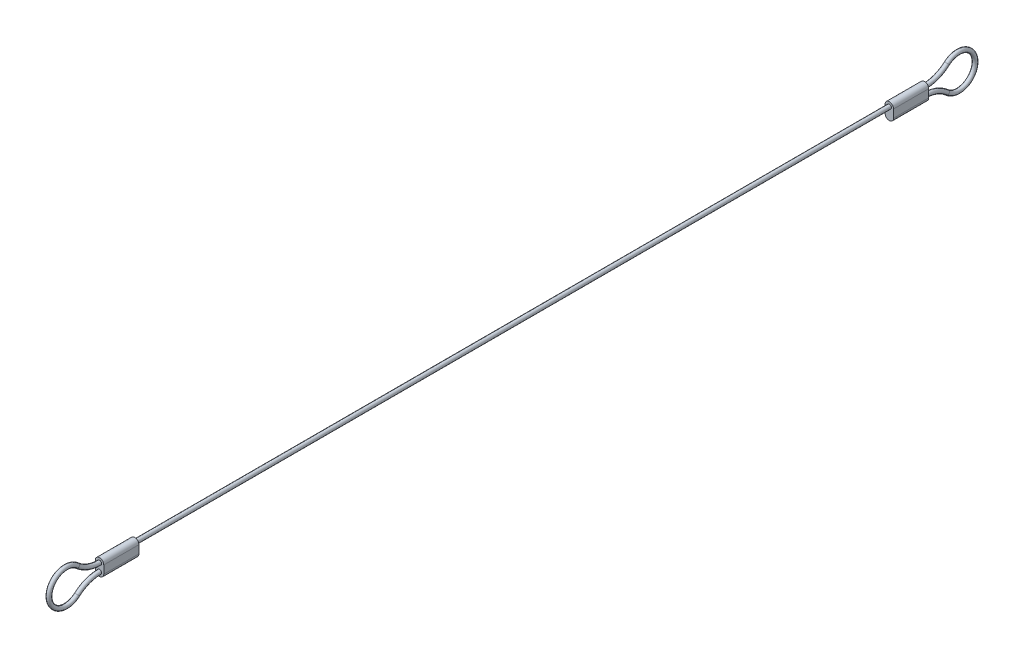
ISO-10303-21;
HEADER;
FILE_DESCRIPTION(('STEP AP214'),'2;1');
FILE_NAME('part.step','',(''),(''),'','','');
FILE_SCHEMA(('AUTOMOTIVE_DESIGN { 1 0 10303 214 1 1 1 1 }'));
ENDSEC;
DATA;
#1=APPLICATION_CONTEXT('core data for automotive mechanical design processes');
#2=APPLICATION_PROTOCOL_DEFINITION('international standard','automotive_design',2000,#1);
#3=PRODUCT_CONTEXT('',#1,'mechanical');
#4=PRODUCT('Part','Part','',(#3));
#5=PRODUCT_RELATED_PRODUCT_CATEGORY('part','',(#4));
#6=PRODUCT_DEFINITION_FORMATION('','',#4);
#7=PRODUCT_DEFINITION_CONTEXT('part definition',#1,'design');
#8=PRODUCT_DEFINITION('design','',#6,#7);
#9=PRODUCT_DEFINITION_SHAPE('','',#8);
#10=(LENGTH_UNIT() NAMED_UNIT(*) SI_UNIT(.MILLI.,.METRE.));
#11=(NAMED_UNIT(*) PLANE_ANGLE_UNIT() SI_UNIT($,.RADIAN.));
#12=(NAMED_UNIT(*) SI_UNIT($,.STERADIAN.) SOLID_ANGLE_UNIT());
#13=UNCERTAINTY_MEASURE_WITH_UNIT(LENGTH_MEASURE(1.E-05),#10,'distance_accuracy_value','');
#14=(GEOMETRIC_REPRESENTATION_CONTEXT(3) GLOBAL_UNCERTAINTY_ASSIGNED_CONTEXT((#13)) GLOBAL_UNIT_ASSIGNED_CONTEXT((#10,
#11,#12)) REPRESENTATION_CONTEXT('',''));
#15=CARTESIAN_POINT('',(0.,0.,0.));
#16=DIRECTION('',(0.,0.,1.));
#17=DIRECTION('',(1.,0.,0.));
#18=AXIS2_PLACEMENT_3D('',#15,#16,#17);
#19=CARTESIAN_POINT('',(0.,0.,-117.4));
#20=DIRECTION('',(0.,0.,1.));
#21=DIRECTION('',(1.,0.,0.));
#22=AXIS2_PLACEMENT_3D('',#19,#20,#21);
#23=CYLINDRICAL_SURFACE('',#22,0.595);
#24=CARTESIAN_POINT('',(0.,0.,-107.4));
#25=DIRECTION('',(0.,0.,1.));
#26=DIRECTION('',(0.,-1.,0.));
#27=AXIS2_PLACEMENT_3D('',#24,#25,#26);
#28=CIRCLE('',#27,0.595);
#29=CARTESIAN_POINT('',(0.,-0.595,-107.4));
#30=VERTEX_POINT('',#29);
#31=EDGE_CURVE('E11',#30,#30,#28,.F.);
#32=ORIENTED_EDGE('',*,*,#31,.F.);
#33=EDGE_LOOP('',(#32));
#34=FACE_BOUND('',#33,.T.);
#35=CARTESIAN_POINT('',(0.,0.,107.4));
#36=DIRECTION('',(0.,0.,-1.));
#37=DIRECTION('',(0.,1.,0.));
#38=AXIS2_PLACEMENT_3D('',#35,#36,#37);
#39=CIRCLE('',#38,0.595);
#40=CARTESIAN_POINT('',(0.,0.595,107.4));
#41=VERTEX_POINT('',#40);
#42=EDGE_CURVE('E51',#41,#41,#39,.F.);
#43=ORIENTED_EDGE('',*,*,#42,.F.);
#44=EDGE_LOOP('',(#43));
#45=FACE_BOUND('',#44,.T.);
#46=ADVANCED_FACE('F41',(#34,#45),#23,.T.);
#47=CARTESIAN_POINT('',(0.,1.69713780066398E-13,117.4));
#48=DIRECTION('',(0.,0.,-1.));
#49=DIRECTION('',(0.,1.,0.));
#50=AXIS2_PLACEMENT_3D('',#47,#48,#49);
#51=PLANE('',#50);
#52=CARTESIAN_POINT('',(0.,1.69713780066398E-13,117.4));
#53=DIRECTION('',(0.,0.,-1.));
#54=DIRECTION('',(0.,1.,0.));
#55=AXIS2_PLACEMENT_3D('',#52,#53,#54);
#56=CIRCLE('',#55,1.2);
#57=CARTESIAN_POINT('',(-1.2,1.69860737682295E-13,117.4));
#58=VERTEX_POINT('',#57);
#59=CARTESIAN_POINT('',(1.2,1.695668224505E-13,117.4));
#60=VERTEX_POINT('',#59);
#61=EDGE_CURVE('E185',#58,#60,#56,.T.);
#62=ORIENTED_EDGE('',*,*,#61,.F.);
#63=DIRECTION('',(0.,1.,0.));
#64=VECTOR('',#63,1.);
#65=CARTESIAN_POINT('',(-1.2,1.69860737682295E-13,117.4));
#66=LINE('',#65,#64);
#67=CARTESIAN_POINT('',(-1.2,-2.26625258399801,117.4));
#68=VERTEX_POINT('',#67);
#69=EDGE_CURVE('E83',#68,#58,#66,.T.);
#70=ORIENTED_EDGE('',*,*,#69,.F.);
#71=CARTESIAN_POINT('',(0.,-2.26625258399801,117.4));
#72=DIRECTION('',(0.,0.,-1.));
#73=DIRECTION('',(0.,1.,0.));
#74=AXIS2_PLACEMENT_3D('',#71,#72,#73);
#75=CIRCLE('',#74,1.2);
#76=CARTESIAN_POINT('',(1.2,-2.26625258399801,117.4));
#77=VERTEX_POINT('',#76);
#78=EDGE_CURVE('E77',#77,#68,#75,.T.);
#79=ORIENTED_EDGE('',*,*,#78,.F.);
#80=DIRECTION('',(0.,-1.,0.));
#81=VECTOR('',#80,1.);
#82=CARTESIAN_POINT('',(1.2,1.695668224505E-13,117.4));
#83=LINE('',#82,#81);
#84=EDGE_CURVE('E189',#60,#77,#83,.T.);
#85=ORIENTED_EDGE('',*,*,#84,.F.);
#86=EDGE_LOOP('',(#62,#70,#79,#85));
#87=FACE_BOUND('',#86,.T.);
#88=CARTESIAN_POINT('',(0.,0.,117.4));
#89=DIRECTION('',(0.,0.,-1.));
#90=DIRECTION('',(0.,1.,0.));
#91=AXIS2_PLACEMENT_3D('',#88,#89,#90);
#92=CIRCLE('',#91,0.595);
#93=CARTESIAN_POINT('',(0.,-0.595000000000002,117.4));
#94=VERTEX_POINT('',#93);
#95=EDGE_CURVE('E207',#94,#94,#92,.F.);
#96=ORIENTED_EDGE('',*,*,#95,.F.);
#97=EDGE_LOOP('',(#96));
#98=FACE_BOUND('',#97,.T.);
#99=CARTESIAN_POINT('',(0.,-2.26625258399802,117.4));
#100=DIRECTION('',(0.,0.,-1.));
#101=DIRECTION('',(1.,0.,0.));
#102=AXIS2_PLACEMENT_3D('',#99,#100,#101);
#103=CIRCLE('',#102,0.595);
#104=CARTESIAN_POINT('',(0.,-1.67125258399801,117.4));
#105=VERTEX_POINT('',#104);
#106=EDGE_CURVE('E233',#105,#105,#103,.T.);
#107=ORIENTED_EDGE('',*,*,#106,.T.);
#108=EDGE_LOOP('',(#107));
#109=FACE_BOUND('',#108,.T.);
#110=ADVANCED_FACE('F243',(#87,#98,#109),#51,.F.);
#111=CARTESIAN_POINT('',(0.,1.55257751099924E-13,107.4));
#112=DIRECTION('',(0.,0.,1.));
#113=DIRECTION('',(0.,-1.,0.));
#114=AXIS2_PLACEMENT_3D('',#111,#112,#113);
#115=CYLINDRICAL_SURFACE('',#114,1.2);
#116=ORIENTED_EDGE('',*,*,#61,.T.);
#117=DIRECTION('',(0.,0.,1.));
#118=VECTOR('',#117,1.);
#119=CARTESIAN_POINT('',(1.2,1.55110793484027E-13,107.4));
#120=LINE('',#119,#118);
#121=CARTESIAN_POINT('',(1.2,1.55110793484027E-13,107.4));
#122=VERTEX_POINT('',#121);
#123=EDGE_CURVE('E204',#122,#60,#120,.T.);
#124=ORIENTED_EDGE('',*,*,#123,.F.);
#125=CARTESIAN_POINT('',(0.,1.55257751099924E-13,107.4));
#126=DIRECTION('',(0.,0.,-1.));
#127=DIRECTION('',(0.,1.,0.));
#128=AXIS2_PLACEMENT_3D('',#125,#126,#127);
#129=CIRCLE('',#128,1.2);
#130=CARTESIAN_POINT('',(-1.2,1.55404708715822E-13,107.4));
#131=VERTEX_POINT('',#130);
#132=EDGE_CURVE('E174',#131,#122,#129,.T.);
#133=ORIENTED_EDGE('',*,*,#132,.F.);
#134=DIRECTION('',(0.,0.,1.));
#135=VECTOR('',#134,1.);
#136=CARTESIAN_POINT('',(-1.2,1.55404708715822E-13,107.4));
#137=LINE('',#136,#135);
#138=EDGE_CURVE('E184',#131,#58,#137,.T.);
#139=ORIENTED_EDGE('',*,*,#138,.T.);
#140=EDGE_LOOP('',(#116,#124,#133,#139));
#141=FACE_BOUND('',#140,.T.);
#142=ADVANCED_FACE('F249',(#141),#115,.T.);
#143=CARTESIAN_POINT('',(1.2,1.55110793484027E-13,107.4));
#144=DIRECTION('',(-1.,0.,0.));
#145=DIRECTION('',(0.,0.,1.));
#146=AXIS2_PLACEMENT_3D('',#143,#144,#145);
#147=PLANE('',#146);
#148=ORIENTED_EDGE('',*,*,#84,.T.);
#149=DIRECTION('',(0.,0.,1.));
#150=VECTOR('',#149,1.);
#151=CARTESIAN_POINT('',(1.2,-2.26625258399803,107.4));
#152=LINE('',#151,#150);
#153=CARTESIAN_POINT('',(1.2,-2.26625258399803,107.4));
#154=VERTEX_POINT('',#153);
#155=EDGE_CURVE('E201',#154,#77,#152,.T.);
#156=ORIENTED_EDGE('',*,*,#155,.F.);
#157=DIRECTION('',(0.,-1.,0.));
#158=VECTOR('',#157,1.);
#159=CARTESIAN_POINT('',(1.2,1.55110793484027E-13,107.4));
#160=LINE('',#159,#158);
#161=EDGE_CURVE('E91',#122,#154,#160,.T.);
#162=ORIENTED_EDGE('',*,*,#161,.F.);
#163=ORIENTED_EDGE('',*,*,#123,.T.);
#164=EDGE_LOOP('',(#148,#156,#162,#163));
#165=FACE_BOUND('',#164,.T.);
#166=ADVANCED_FACE('F291',(#165),#147,.F.);
#167=CARTESIAN_POINT('',(0.,-2.26625258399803,107.4));
#168=DIRECTION('',(0.,0.,1.));
#169=DIRECTION('',(0.,-1.,0.));
#170=AXIS2_PLACEMENT_3D('',#167,#168,#169);
#171=CYLINDRICAL_SURFACE('',#170,1.2);
#172=ORIENTED_EDGE('',*,*,#78,.T.);
#173=DIRECTION('',(0.,0.,1.));
#174=VECTOR('',#173,1.);
#175=CARTESIAN_POINT('',(-1.2,-2.26625258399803,107.4));
#176=LINE('',#175,#174);
#177=CARTESIAN_POINT('',(-1.2,-2.26625258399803,107.4));
#178=VERTEX_POINT('',#177);
#179=EDGE_CURVE('E198',#178,#68,#176,.T.);
#180=ORIENTED_EDGE('',*,*,#179,.F.);
#181=CARTESIAN_POINT('',(0.,-2.26625258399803,107.4));
#182=DIRECTION('',(0.,0.,-1.));
#183=DIRECTION('',(0.,1.,0.));
#184=AXIS2_PLACEMENT_3D('',#181,#182,#183);
#185=CIRCLE('',#184,1.2);
#186=EDGE_CURVE('E179',#154,#178,#185,.T.);
#187=ORIENTED_EDGE('',*,*,#186,.F.);
#188=ORIENTED_EDGE('',*,*,#155,.T.);
#189=EDGE_LOOP('',(#172,#180,#187,#188));
#190=FACE_BOUND('',#189,.T.);
#191=ADVANCED_FACE('F284',(#190),#171,.T.);
#192=CARTESIAN_POINT('',(-1.2,1.55404708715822E-13,107.4));
#193=DIRECTION('',(1.,0.,0.));
#194=DIRECTION('',(0.,1.,0.));
#195=AXIS2_PLACEMENT_3D('',#192,#193,#194);
#196=PLANE('',#195);
#197=ORIENTED_EDGE('',*,*,#69,.T.);
#198=ORIENTED_EDGE('',*,*,#138,.F.);
#199=DIRECTION('',(0.,1.,0.));
#200=VECTOR('',#199,1.);
#201=CARTESIAN_POINT('',(-1.2,1.55404708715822E-13,107.4));
#202=LINE('',#201,#200);
#203=EDGE_CURVE('E59',#178,#131,#202,.T.);
#204=ORIENTED_EDGE('',*,*,#203,.F.);
#205=ORIENTED_EDGE('',*,*,#179,.T.);
#206=EDGE_LOOP('',(#197,#198,#204,#205));
#207=FACE_BOUND('',#206,.T.);
#208=ADVANCED_FACE('F279',(#207),#196,.F.);
#209=CARTESIAN_POINT('',(0.,1.55257751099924E-13,107.4));
#210=DIRECTION('',(0.,0.,-1.));
#211=DIRECTION('',(0.,1.,0.));
#212=AXIS2_PLACEMENT_3D('',#209,#210,#211);
#213=PLANE('',#212);
#214=ORIENTED_EDGE('',*,*,#42,.T.);
#215=EDGE_LOOP('',(#214));
#216=FACE_BOUND('',#215,.T.);
#217=ORIENTED_EDGE('',*,*,#132,.T.);
#218=ORIENTED_EDGE('',*,*,#161,.T.);
#219=ORIENTED_EDGE('',*,*,#186,.T.);
#220=ORIENTED_EDGE('',*,*,#203,.T.);
#221=EDGE_LOOP('',(#217,#218,#219,#220));
#222=FACE_BOUND('',#221,.T.);
#223=ADVANCED_FACE('F240',(#216,#222),#213,.T.);
#224=CARTESIAN_POINT('',(0.,-11.866252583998,117.4));
#225=DIRECTION('',(-1.,0.,0.));
#226=DIRECTION('',(0.,0.,1.));
#227=AXIS2_PLACEMENT_3D('',#224,#225,#226);
#228=TOROIDAL_SURFACE('',#227,9.59999999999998,0.595);
#229=CARTESIAN_POINT('',(0.,-4.71083505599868,123.8));
#230=DIRECTION('',(0.,0.666666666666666,-0.74535599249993));
#231=DIRECTION('',(1.,0.,0.));
#232=AXIS2_PLACEMENT_3D('',#229,#230,#231);
#233=CIRCLE('',#232,0.595);
#234=CARTESIAN_POINT('',(0.,-4.26734824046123,124.196666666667));
#235=VERTEX_POINT('',#234);
#236=EDGE_CURVE('E229',#235,#235,#233,.T.);
#237=CARTESIAN_POINT('',(0.,-11.866252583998,117.4));
#238=DIRECTION('',(-1.,0.,0.));
#239=DIRECTION('',(0.,0.,1.));
#240=AXIS2_PLACEMENT_3D('',#237,#238,#239);
#241=CIRCLE('',#240,10.195);
#242=EDGE_CURVE('',#235,#105,#241,.T.);
#243=ORIENTED_EDGE('',*,*,#236,.T.);
#244=ORIENTED_EDGE('',*,*,#106,.F.);
#245=ORIENTED_EDGE('',*,*,#242,.T.);
#246=ORIENTED_EDGE('',*,*,#242,.F.);
#247=EDGE_LOOP('',(#243,#245,#244,#246));
#248=FACE_BOUND('',#247,.T.);
#249=ADVANCED_FACE('F43',(#248),#228,.T.);
#250=CARTESIAN_POINT('',(0.,-1.13312629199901,127.));
#251=DIRECTION('',(1.,0.,0.));
#252=DIRECTION('',(0.,0.,-1.));
#253=AXIS2_PLACEMENT_3D('',#250,#251,#252);
#254=TOROIDAL_SURFACE('',#253,4.80000000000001,0.595);
#255=ORIENTED_EDGE('',*,*,#236,.F.);
#256=EDGE_LOOP('',(#255));
#257=FACE_BOUND('',#256,.T.);
#258=CARTESIAN_POINT('',(0.,2.44458247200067,123.8));
#259=DIRECTION('',(0.,0.666666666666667,0.74535599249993));
#260=DIRECTION('',(1.,0.,0.));
#261=AXIS2_PLACEMENT_3D('',#258,#259,#260);
#262=CIRCLE('',#261,0.595);
#263=CARTESIAN_POINT('',(0.,2.00109565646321,124.196666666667));
#264=VERTEX_POINT('',#263);
#265=EDGE_CURVE('E225',#264,#264,#262,.T.);
#266=ORIENTED_EDGE('',*,*,#265,.T.);
#267=EDGE_LOOP('',(#266));
#268=FACE_BOUND('',#267,.T.);
#269=ADVANCED_FACE('F259',(#257,#268),#254,.T.);
#270=CARTESIAN_POINT('',(0.,9.59999999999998,117.4));
#271=DIRECTION('',(-1.,0.,0.));
#272=DIRECTION('',(0.,0.,1.));
#273=AXIS2_PLACEMENT_3D('',#270,#271,#272);
#274=TOROIDAL_SURFACE('',#273,9.59999999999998,0.595);
#275=CARTESIAN_POINT('',(0.,9.59999999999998,117.4));
#276=DIRECTION('',(-1.,0.,0.));
#277=DIRECTION('',(0.,0.,1.));
#278=AXIS2_PLACEMENT_3D('',#275,#276,#277);
#279=CIRCLE('',#278,10.195);
#280=EDGE_CURVE('',#94,#264,#279,.T.);
#281=ORIENTED_EDGE('',*,*,#95,.T.);
#282=ORIENTED_EDGE('',*,*,#265,.F.);
#283=ORIENTED_EDGE('',*,*,#280,.T.);
#284=ORIENTED_EDGE('',*,*,#280,.F.);
#285=EDGE_LOOP('',(#281,#283,#282,#284));
#286=FACE_BOUND('',#285,.T.);
#287=ADVANCED_FACE('F257',(#286),#274,.T.);
#288=CARTESIAN_POINT('',(0.,1.55257751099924E-13,-107.4));
#289=DIRECTION('',(0.,0.,-1.));
#290=DIRECTION('',(0.,1.,0.));
#291=AXIS2_PLACEMENT_3D('',#288,#289,#290);
#292=CYLINDRICAL_SURFACE('',#291,1.2);
#293=CARTESIAN_POINT('',(0.,1.69713780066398E-13,-117.4));
#294=DIRECTION('',(0.,0.,-1.));
#295=DIRECTION('',(0.,1.,0.));
#296=AXIS2_PLACEMENT_3D('',#293,#294,#295);
#297=CIRCLE('',#296,1.2);
#298=CARTESIAN_POINT('',(-1.2,1.69860737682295E-13,-117.4));
#299=VERTEX_POINT('',#298);
#300=CARTESIAN_POINT('',(1.2,1.695668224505E-13,-117.4));
#301=VERTEX_POINT('',#300);
#302=EDGE_CURVE('E124',#299,#301,#297,.T.);
#303=ORIENTED_EDGE('',*,*,#302,.F.);
#304=DIRECTION('',(0.,0.,-1.));
#305=VECTOR('',#304,1.);
#306=CARTESIAN_POINT('',(-1.2,1.55404708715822E-13,-107.4));
#307=LINE('',#306,#305);
#308=CARTESIAN_POINT('',(-1.2,1.55404708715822E-13,-107.4));
#309=VERTEX_POINT('',#308);
#310=EDGE_CURVE('E118',#309,#299,#307,.T.);
#311=ORIENTED_EDGE('',*,*,#310,.F.);
#312=CARTESIAN_POINT('',(0.,1.55257751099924E-13,-107.4));
#313=DIRECTION('',(0.,0.,-1.));
#314=DIRECTION('',(0.,1.,0.));
#315=AXIS2_PLACEMENT_3D('',#312,#313,#314);
#316=CIRCLE('',#315,1.2);
#317=CARTESIAN_POINT('',(1.2,1.55110793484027E-13,-107.4));
#318=VERTEX_POINT('',#317);
#319=EDGE_CURVE('E121',#309,#318,#316,.T.);
#320=ORIENTED_EDGE('',*,*,#319,.T.);
#321=DIRECTION('',(0.,0.,-1.));
#322=VECTOR('',#321,1.);
#323=CARTESIAN_POINT('',(1.2,1.55110793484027E-13,-107.4));
#324=LINE('',#323,#322);
#325=EDGE_CURVE('E155',#318,#301,#324,.T.);
#326=ORIENTED_EDGE('',*,*,#325,.T.);
#327=EDGE_LOOP('',(#303,#311,#320,#326));
#328=FACE_BOUND('',#327,.T.);
#329=ADVANCED_FACE('F120',(#328),#292,.T.);
#330=CARTESIAN_POINT('',(-1.2,1.55404708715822E-13,-107.4));
#331=DIRECTION('',(-1.,0.,0.));
#332=DIRECTION('',(0.,-1.,0.));
#333=AXIS2_PLACEMENT_3D('',#330,#331,#332);
#334=PLANE('',#333);
#335=DIRECTION('',(0.,1.,0.));
#336=VECTOR('',#335,1.);
#337=CARTESIAN_POINT('',(-1.2,1.69860737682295E-13,-117.4));
#338=LINE('',#337,#336);
#339=CARTESIAN_POINT('',(-1.2,-2.26625258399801,-117.4));
#340=VERTEX_POINT('',#339);
#341=EDGE_CURVE('E157',#340,#299,#338,.T.);
#342=ORIENTED_EDGE('',*,*,#341,.F.);
#343=DIRECTION('',(0.,0.,-1.));
#344=VECTOR('',#343,1.);
#345=CARTESIAN_POINT('',(-1.2,-2.26625258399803,-107.4));
#346=LINE('',#345,#344);
#347=CARTESIAN_POINT('',(-1.2,-2.26625258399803,-107.4));
#348=VERTEX_POINT('',#347);
#349=EDGE_CURVE('E131',#348,#340,#346,.T.);
#350=ORIENTED_EDGE('',*,*,#349,.F.);
#351=DIRECTION('',(0.,1.,0.));
#352=VECTOR('',#351,1.);
#353=CARTESIAN_POINT('',(-1.2,1.55404708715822E-13,-107.4));
#354=LINE('',#353,#352);
#355=EDGE_CURVE('E137',#348,#309,#354,.T.);
#356=ORIENTED_EDGE('',*,*,#355,.T.);
#357=ORIENTED_EDGE('',*,*,#310,.T.);
#358=EDGE_LOOP('',(#342,#350,#356,#357));
#359=FACE_BOUND('',#358,.T.);
#360=ADVANCED_FACE('F144',(#359),#334,.T.);
#361=CARTESIAN_POINT('',(0.,-2.26625258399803,-107.4));
#362=DIRECTION('',(0.,0.,-1.));
#363=DIRECTION('',(0.,1.,0.));
#364=AXIS2_PLACEMENT_3D('',#361,#362,#363);
#365=CYLINDRICAL_SURFACE('',#364,1.2);
#366=CARTESIAN_POINT('',(0.,-2.26625258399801,-117.4));
#367=DIRECTION('',(0.,0.,-1.));
#368=DIRECTION('',(0.,1.,0.));
#369=AXIS2_PLACEMENT_3D('',#366,#367,#368);
#370=CIRCLE('',#369,1.2);
#371=CARTESIAN_POINT('',(1.2,-2.26625258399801,-117.4));
#372=VERTEX_POINT('',#371);
#373=EDGE_CURVE('E160',#372,#340,#370,.T.);
#374=ORIENTED_EDGE('',*,*,#373,.F.);
#375=DIRECTION('',(0.,0.,-1.));
#376=VECTOR('',#375,1.);
#377=CARTESIAN_POINT('',(1.2,-2.26625258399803,-107.4));
#378=LINE('',#377,#376);
#379=CARTESIAN_POINT('',(1.2,-2.26625258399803,-107.4));
#380=VERTEX_POINT('',#379);
#381=EDGE_CURVE('E169',#380,#372,#378,.T.);
#382=ORIENTED_EDGE('',*,*,#381,.F.);
#383=CARTESIAN_POINT('',(0.,-2.26625258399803,-107.4));
#384=DIRECTION('',(0.,0.,-1.));
#385=DIRECTION('',(0.,1.,0.));
#386=AXIS2_PLACEMENT_3D('',#383,#384,#385);
#387=CIRCLE('',#386,1.2);
#388=EDGE_CURVE('E146',#380,#348,#387,.T.);
#389=ORIENTED_EDGE('',*,*,#388,.T.);
#390=ORIENTED_EDGE('',*,*,#349,.T.);
#391=EDGE_LOOP('',(#374,#382,#389,#390));
#392=FACE_BOUND('',#391,.T.);
#393=ADVANCED_FACE('F324',(#392),#365,.T.);
#394=CARTESIAN_POINT('',(1.2,1.55110793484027E-13,-107.4));
#395=DIRECTION('',(1.,0.,0.));
#396=DIRECTION('',(0.,0.,-1.));
#397=AXIS2_PLACEMENT_3D('',#394,#395,#396);
#398=PLANE('',#397);
#399=DIRECTION('',(0.,-1.,0.));
#400=VECTOR('',#399,1.);
#401=CARTESIAN_POINT('',(1.2,1.695668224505E-13,-117.4));
#402=LINE('',#401,#400);
#403=EDGE_CURVE('E142',#301,#372,#402,.T.);
#404=ORIENTED_EDGE('',*,*,#403,.F.);
#405=ORIENTED_EDGE('',*,*,#325,.F.);
#406=DIRECTION('',(0.,-1.,0.));
#407=VECTOR('',#406,1.);
#408=CARTESIAN_POINT('',(1.2,1.55110793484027E-13,-107.4));
#409=LINE('',#408,#407);
#410=EDGE_CURVE('E140',#318,#380,#409,.T.);
#411=ORIENTED_EDGE('',*,*,#410,.T.);
#412=ORIENTED_EDGE('',*,*,#381,.T.);
#413=EDGE_LOOP('',(#404,#405,#411,#412));
#414=FACE_BOUND('',#413,.T.);
#415=ADVANCED_FACE('F321',(#414),#398,.T.);
#416=CARTESIAN_POINT('',(0.,1.55257751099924E-13,-107.4));
#417=DIRECTION('',(0.,0.,1.));
#418=DIRECTION('',(0.,1.,0.));
#419=AXIS2_PLACEMENT_3D('',#416,#417,#418);
#420=PLANE('',#419);
#421=ORIENTED_EDGE('',*,*,#31,.T.);
#422=EDGE_LOOP('',(#421));
#423=FACE_BOUND('',#422,.T.);
#424=ORIENTED_EDGE('',*,*,#319,.F.);
#425=ORIENTED_EDGE('',*,*,#355,.F.);
#426=ORIENTED_EDGE('',*,*,#388,.F.);
#427=ORIENTED_EDGE('',*,*,#410,.F.);
#428=EDGE_LOOP('',(#424,#425,#426,#427));
#429=FACE_BOUND('',#428,.T.);
#430=ADVANCED_FACE('F135',(#423,#429),#420,.T.);
#431=CARTESIAN_POINT('',(0.,1.69713780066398E-13,-117.4));
#432=DIRECTION('',(0.,0.,1.));
#433=DIRECTION('',(0.,1.,0.));
#434=AXIS2_PLACEMENT_3D('',#431,#432,#433);
#435=PLANE('',#434);
#436=CARTESIAN_POINT('',(0.,-2.26625258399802,-117.4));
#437=DIRECTION('',(0.,0.,-1.));
#438=DIRECTION('',(1.,0.,0.));
#439=AXIS2_PLACEMENT_3D('',#436,#437,#438);
#440=CIRCLE('',#439,0.595);
#441=CARTESIAN_POINT('',(0.,-1.67125258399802,-117.4));
#442=VERTEX_POINT('',#441);
#443=EDGE_CURVE('E130',#442,#442,#440,.T.);
#444=ORIENTED_EDGE('',*,*,#443,.F.);
#445=EDGE_LOOP('',(#444));
#446=FACE_BOUND('',#445,.T.);
#447=CARTESIAN_POINT('',(0.,0.,-117.4));
#448=DIRECTION('',(0.,0.,1.));
#449=DIRECTION('',(1.,0.,0.));
#450=AXIS2_PLACEMENT_3D('',#447,#448,#449);
#451=CIRCLE('',#450,0.595);
#452=CARTESIAN_POINT('',(0.,-0.595000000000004,-117.4));
#453=VERTEX_POINT('',#452);
#454=EDGE_CURVE('E221',#453,#453,#451,.T.);
#455=ORIENTED_EDGE('',*,*,#454,.T.);
#456=EDGE_LOOP('',(#455));
#457=FACE_BOUND('',#456,.T.);
#458=ORIENTED_EDGE('',*,*,#302,.T.);
#459=ORIENTED_EDGE('',*,*,#403,.T.);
#460=ORIENTED_EDGE('',*,*,#373,.T.);
#461=ORIENTED_EDGE('',*,*,#341,.T.);
#462=EDGE_LOOP('',(#458,#459,#460,#461));
#463=FACE_BOUND('',#462,.T.);
#464=ADVANCED_FACE('F300',(#446,#457,#463),#435,.F.);
#465=CARTESIAN_POINT('',(0.,-11.866252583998,-117.4));
#466=DIRECTION('',(-1.,0.,0.));
#467=DIRECTION('',(0.,0.,1.));
#468=AXIS2_PLACEMENT_3D('',#465,#466,#467);
#469=TOROIDAL_SURFACE('',#468,9.59999999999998,0.595);
#470=CARTESIAN_POINT('',(0.,-4.71083505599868,-123.8));
#471=DIRECTION('',(0.,-0.666666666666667,-0.74535599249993));
#472=DIRECTION('',(1.,0.,0.));
#473=AXIS2_PLACEMENT_3D('',#470,#471,#472);
#474=CIRCLE('',#473,0.595);
#475=CARTESIAN_POINT('',(0.,-4.26734824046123,-124.196666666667));
#476=VERTEX_POINT('',#475);
#477=EDGE_CURVE('E210',#476,#476,#474,.T.);
#478=CARTESIAN_POINT('',(0.,-11.866252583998,-117.4));
#479=DIRECTION('',(-1.,0.,0.));
#480=DIRECTION('',(0.,0.,1.));
#481=AXIS2_PLACEMENT_3D('',#478,#479,#480);
#482=CIRCLE('',#481,10.195);
#483=EDGE_CURVE('',#442,#476,#482,.T.);
#484=ORIENTED_EDGE('',*,*,#443,.T.);
#485=ORIENTED_EDGE('',*,*,#477,.F.);
#486=ORIENTED_EDGE('',*,*,#483,.T.);
#487=ORIENTED_EDGE('',*,*,#483,.F.);
#488=EDGE_LOOP('',(#484,#486,#485,#487));
#489=FACE_BOUND('',#488,.T.);
#490=ADVANCED_FACE('F297',(#489),#469,.T.);
#491=CARTESIAN_POINT('',(0.,-1.13312629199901,-127.));
#492=DIRECTION('',(1.,0.,0.));
#493=DIRECTION('',(0.,0.,-1.));
#494=AXIS2_PLACEMENT_3D('',#491,#492,#493);
#495=TOROIDAL_SURFACE('',#494,4.80000000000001,0.595);
#496=CARTESIAN_POINT('',(0.,2.44458247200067,-123.8));
#497=DIRECTION('',(0.,-0.666666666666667,0.74535599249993));
#498=DIRECTION('',(1.,0.,0.));
#499=AXIS2_PLACEMENT_3D('',#496,#497,#498);
#500=CIRCLE('',#499,0.595);
#501=CARTESIAN_POINT('',(0.,2.00109565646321,-124.196666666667));
#502=VERTEX_POINT('',#501);
#503=EDGE_CURVE('E217',#502,#502,#500,.T.);
#504=ORIENTED_EDGE('',*,*,#503,.F.);
#505=EDGE_LOOP('',(#504));
#506=FACE_BOUND('',#505,.T.);
#507=ORIENTED_EDGE('',*,*,#477,.T.);
#508=EDGE_LOOP('',(#507));
#509=FACE_BOUND('',#508,.T.);
#510=ADVANCED_FACE('F299',(#506,#509),#495,.T.);
#511=CARTESIAN_POINT('',(0.,9.59999999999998,-117.4));
#512=DIRECTION('',(-1.,0.,0.));
#513=DIRECTION('',(0.,0.,1.));
#514=AXIS2_PLACEMENT_3D('',#511,#512,#513);
#515=TOROIDAL_SURFACE('',#514,9.59999999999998,0.595);
#516=CARTESIAN_POINT('',(0.,9.59999999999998,-117.4));
#517=DIRECTION('',(-1.,0.,0.));
#518=DIRECTION('',(0.,0.,1.));
#519=AXIS2_PLACEMENT_3D('',#516,#517,#518);
#520=CIRCLE('',#519,10.195);
#521=EDGE_CURVE('',#502,#453,#520,.T.);
#522=ORIENTED_EDGE('',*,*,#503,.T.);
#523=ORIENTED_EDGE('',*,*,#454,.F.);
#524=ORIENTED_EDGE('',*,*,#521,.T.);
#525=ORIENTED_EDGE('',*,*,#521,.F.);
#526=EDGE_LOOP('',(#522,#524,#523,#525));
#527=FACE_BOUND('',#526,.T.);
#528=ADVANCED_FACE('F255',(#527),#515,.T.);
#529=CLOSED_SHELL('',(#46,#110,#142,#166,#191,#208,#223,#249,#269,#287,#329,#360,#393,#415,#430,
#464,#490,#510,#528));
#530=MANIFOLD_SOLID_BREP('B2',#529);
#531=ADVANCED_BREP_SHAPE_REPRESENTATION('',(#18,#530),#14);
#532=SHAPE_DEFINITION_REPRESENTATION(#9,#531);
ENDSEC;
END-ISO-10303-21;
